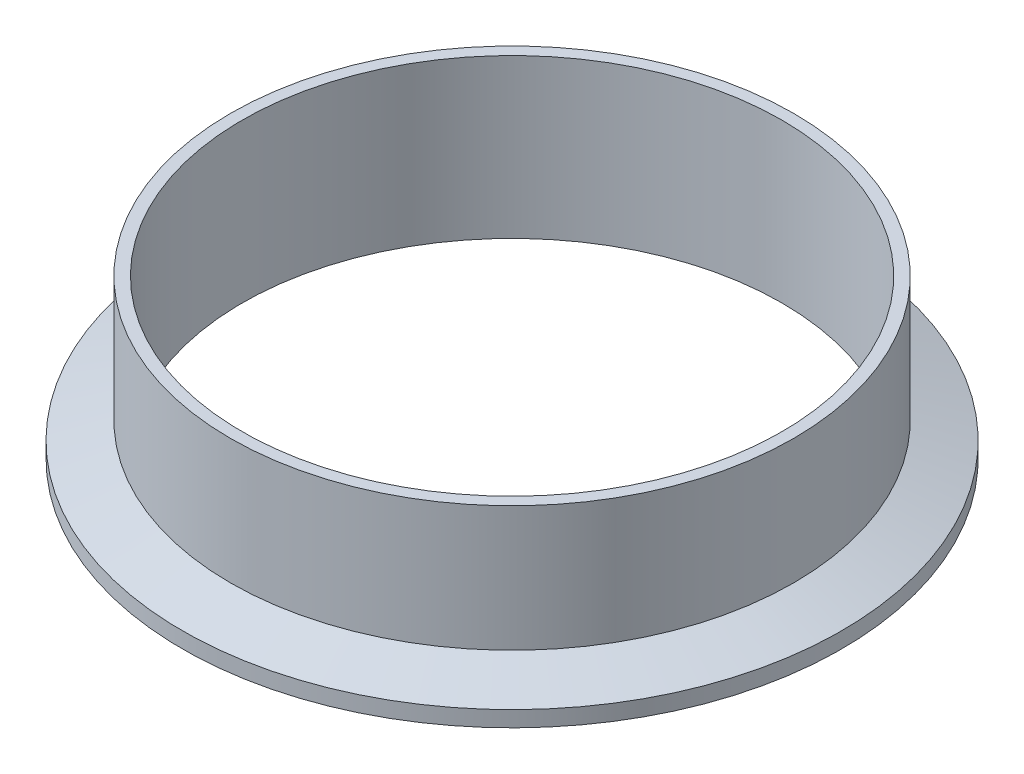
ISO-10303-21;
HEADER;
FILE_DESCRIPTION(('STEP AP214'),'2;1');
FILE_NAME('part.step','',(''),(''),'','','');
FILE_SCHEMA(('AUTOMOTIVE_DESIGN { 1 0 10303 214 1 1 1 1 }'));
ENDSEC;
DATA;
#1=APPLICATION_CONTEXT('core data for automotive mechanical design processes');
#2=APPLICATION_PROTOCOL_DEFINITION('international standard','automotive_design',2000,#1);
#3=PRODUCT_CONTEXT('',#1,'mechanical');
#4=PRODUCT('Part','Part','',(#3));
#5=PRODUCT_RELATED_PRODUCT_CATEGORY('part','',(#4));
#6=PRODUCT_DEFINITION_FORMATION('','',#4);
#7=PRODUCT_DEFINITION_CONTEXT('part definition',#1,'design');
#8=PRODUCT_DEFINITION('design','',#6,#7);
#9=PRODUCT_DEFINITION_SHAPE('','',#8);
#10=(LENGTH_UNIT() NAMED_UNIT(*) SI_UNIT(.MILLI.,.METRE.));
#11=(NAMED_UNIT(*) PLANE_ANGLE_UNIT() SI_UNIT($,.RADIAN.));
#12=(NAMED_UNIT(*) SI_UNIT($,.STERADIAN.) SOLID_ANGLE_UNIT());
#13=UNCERTAINTY_MEASURE_WITH_UNIT(LENGTH_MEASURE(1.E-05),#10,'distance_accuracy_value','');
#14=(GEOMETRIC_REPRESENTATION_CONTEXT(3) GLOBAL_UNCERTAINTY_ASSIGNED_CONTEXT((#13)) GLOBAL_UNIT_ASSIGNED_CONTEXT((#10,
#11,#12)) REPRESENTATION_CONTEXT('',''));
#15=CARTESIAN_POINT('',(0.,0.,0.));
#16=DIRECTION('',(0.,0.,1.));
#17=DIRECTION('',(1.,0.,0.));
#18=AXIS2_PLACEMENT_3D('',#15,#16,#17);
#19=CARTESIAN_POINT('',(0.,0.787399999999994,0.));
#20=DIRECTION('',(0.,-1.,0.));
#21=DIRECTION('',(0.,0.,-1.));
#22=AXIS2_PLACEMENT_3D('',#19,#20,#21);
#23=TOROIDAL_SURFACE('',#22,56.6185084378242,0.787400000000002);
#24=CARTESIAN_POINT('',(0.,0.,0.));
#25=DIRECTION('',(0.,-1.,0.));
#26=DIRECTION('',(0.,0.,-1.));
#27=AXIS2_PLACEMENT_3D('',#24,#25,#26);
#28=CIRCLE('',#27,56.6185084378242);
#29=CARTESIAN_POINT('',(0.,0.,-56.6185084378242));
#30=VERTEX_POINT('',#29);
#31=EDGE_CURVE('E74',#30,#30,#28,.T.);
#32=ORIENTED_EDGE('',*,*,#31,.T.);
#33=EDGE_LOOP('',(#32));
#34=FACE_BOUND('',#33,.T.);
#35=CARTESIAN_POINT('',(0.,0.474458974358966,0.));
#36=DIRECTION('',(0.,-1.,0.));
#37=DIRECTION('',(0.,0.,-1.));
#38=AXIS2_PLACEMENT_3D('',#35,#36,#37);
#39=CIRCLE('',#38,55.8959666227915);
#40=CARTESIAN_POINT('',(0.,0.474458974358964,-55.8959666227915));
#41=VERTEX_POINT('',#40);
#42=EDGE_CURVE('E12',#41,#41,#39,.T.);
#43=ORIENTED_EDGE('',*,*,#42,.F.);
#44=EDGE_LOOP('',(#43));
#45=FACE_BOUND('',#44,.T.);
#46=ADVANCED_FACE('F40',(#34,#45),#23,.T.);
#47=CARTESIAN_POINT('',(0.,0.,0.));
#48=DIRECTION('',(0.,-1.,0.));
#49=DIRECTION('',(0.,0.,-1.));
#50=AXIS2_PLACEMENT_3D('',#47,#48,#49);
#51=TOROIDAL_SURFACE('',#50,54.8005,1.1938);
#52=CARTESIAN_POINT('',(0.,0.474458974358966,0.));
#53=DIRECTION('',(0.,-1.,0.));
#54=DIRECTION('',(0.,0.,-1.));
#55=AXIS2_PLACEMENT_3D('',#52,#53,#54);
#56=CIRCLE('',#55,53.7050333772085);
#57=CARTESIAN_POINT('',(0.,0.474458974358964,-53.7050333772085));
#58=VERTEX_POINT('',#57);
#59=EDGE_CURVE('E46',#58,#58,#56,.T.);
#60=ORIENTED_EDGE('',*,*,#59,.F.);
#61=EDGE_LOOP('',(#60));
#62=FACE_BOUND('',#61,.T.);
#63=ORIENTED_EDGE('',*,*,#42,.T.);
#64=EDGE_LOOP('',(#63));
#65=FACE_BOUND('',#64,.T.);
#66=ADVANCED_FACE('F122',(#62,#65),#51,.F.);
#67=CARTESIAN_POINT('',(0.,0.787399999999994,0.));
#68=DIRECTION('',(0.,-1.,0.));
#69=DIRECTION('',(0.,0.,-1.));
#70=AXIS2_PLACEMENT_3D('',#67,#68,#69);
#71=TOROIDAL_SURFACE('',#70,52.9824915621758,0.787399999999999);
#72=ORIENTED_EDGE('',*,*,#59,.T.);
#73=EDGE_LOOP('',(#72));
#74=FACE_BOUND('',#73,.T.);
#75=CARTESIAN_POINT('',(0.,0.,0.));
#76=DIRECTION('',(0.,-1.,0.));
#77=DIRECTION('',(0.,0.,-1.));
#78=AXIS2_PLACEMENT_3D('',#75,#76,#77);
#79=CIRCLE('',#78,52.9824915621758);
#80=CARTESIAN_POINT('',(0.,0.,-52.9824915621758));
#81=VERTEX_POINT('',#80);
#82=EDGE_CURVE('E50',#81,#81,#79,.T.);
#83=ORIENTED_EDGE('',*,*,#82,.F.);
#84=EDGE_LOOP('',(#83));
#85=FACE_BOUND('',#84,.T.);
#86=ADVANCED_FACE('F118',(#74,#85),#71,.T.);
#87=CARTESIAN_POINT('',(0.,0.,0.));
#88=DIRECTION('',(0.,1.,0.));
#89=DIRECTION('',(0.,0.,1.));
#90=AXIS2_PLACEMENT_3D('',#87,#88,#89);
#91=PLANE('',#90);
#92=CARTESIAN_POINT('',(0.,0.,0.));
#93=DIRECTION('',(0.,-1.,0.));
#94=DIRECTION('',(0.,0.,-1.));
#95=AXIS2_PLACEMENT_3D('',#92,#93,#94);
#96=CIRCLE('',#95,48.6918);
#97=CARTESIAN_POINT('',(0.,0.,-48.6918));
#98=VERTEX_POINT('',#97);
#99=EDGE_CURVE('E54',#98,#98,#96,.T.);
#100=ORIENTED_EDGE('',*,*,#99,.F.);
#101=EDGE_LOOP('',(#100));
#102=FACE_BOUND('',#101,.T.);
#103=ORIENTED_EDGE('',*,*,#82,.T.);
#104=EDGE_LOOP('',(#103));
#105=FACE_BOUND('',#104,.T.);
#106=ADVANCED_FACE('F112',(#102,#105),#91,.F.);
#107=CARTESIAN_POINT('',(0.,0.,0.));
#108=DIRECTION('',(0.,-1.,0.));
#109=DIRECTION('',(0.,0.,-1.));
#110=AXIS2_PLACEMENT_3D('',#107,#108,#109);
#111=CYLINDRICAL_SURFACE('',#110,48.6918);
#112=ORIENTED_EDGE('',*,*,#99,.T.);
#113=EDGE_LOOP('',(#112));
#114=FACE_BOUND('',#113,.T.);
#115=CARTESIAN_POINT('',(0.,28.575,0.));
#116=DIRECTION('',(0.,-1.,0.));
#117=DIRECTION('',(0.,0.,-1.));
#118=AXIS2_PLACEMENT_3D('',#115,#116,#117);
#119=CIRCLE('',#118,48.6918);
#120=CARTESIAN_POINT('',(0.,28.575,-48.6918));
#121=VERTEX_POINT('',#120);
#122=EDGE_CURVE('E59',#121,#121,#119,.T.);
#123=ORIENTED_EDGE('',*,*,#122,.F.);
#124=EDGE_LOOP('',(#123));
#125=FACE_BOUND('',#124,.T.);
#126=ADVANCED_FACE('F107',(#114,#125),#111,.F.);
#127=CARTESIAN_POINT('',(0.,28.575,0.));
#128=DIRECTION('',(0.,-1.,0.));
#129=DIRECTION('',(0.,0.,-1.));
#130=AXIS2_PLACEMENT_3D('',#127,#128,#129);
#131=PLANE('',#130);
#132=CARTESIAN_POINT('',(0.,28.575,0.));
#133=DIRECTION('',(0.,-1.,0.));
#134=DIRECTION('',(0.,0.,-1.));
#135=AXIS2_PLACEMENT_3D('',#132,#133,#134);
#136=CIRCLE('',#135,50.8);
#137=CARTESIAN_POINT('',(0.,28.575,-50.8));
#138=VERTEX_POINT('',#137);
#139=EDGE_CURVE('E62',#138,#138,#136,.T.);
#140=ORIENTED_EDGE('',*,*,#139,.F.);
#141=EDGE_LOOP('',(#140));
#142=FACE_BOUND('',#141,.T.);
#143=ORIENTED_EDGE('',*,*,#122,.T.);
#144=EDGE_LOOP('',(#143));
#145=FACE_BOUND('',#144,.T.);
#146=ADVANCED_FACE('F101',(#142,#145),#131,.F.);
#147=CARTESIAN_POINT('',(0.,0.,0.));
#148=DIRECTION('',(0.,-1.,0.));
#149=DIRECTION('',(0.,0.,-1.));
#150=AXIS2_PLACEMENT_3D('',#147,#148,#149);
#151=CYLINDRICAL_SURFACE('',#150,50.8);
#152=CARTESIAN_POINT('',(0.,5.99729178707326,0.));
#153=DIRECTION('',(0.,-1.,0.));
#154=DIRECTION('',(0.,0.,-1.));
#155=AXIS2_PLACEMENT_3D('',#152,#153,#154);
#156=CIRCLE('',#155,50.8);
#157=CARTESIAN_POINT('',(0.,5.99729178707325,-50.8));
#158=VERTEX_POINT('',#157);
#159=EDGE_CURVE('E65',#158,#158,#156,.T.);
#160=ORIENTED_EDGE('',*,*,#159,.F.);
#161=EDGE_LOOP('',(#160));
#162=FACE_BOUND('',#161,.T.);
#163=ORIENTED_EDGE('',*,*,#139,.T.);
#164=EDGE_LOOP('',(#163));
#165=FACE_BOUND('',#164,.T.);
#166=ADVANCED_FACE('F95',(#162,#165),#151,.T.);
#167=CARTESIAN_POINT('',(0.,5.99729178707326,0.));
#168=DIRECTION('',(0.,-1.,0.));
#169=DIRECTION('',(0.,0.,-1.));
#170=AXIS2_PLACEMENT_3D('',#167,#168,#169);
#171=CONICAL_SURFACE('',#170,50.8,1.22173047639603);
#172=CARTESIAN_POINT('',(0.,2.84480000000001,0.));
#173=DIRECTION('',(0.,-1.,0.));
#174=DIRECTION('',(0.,0.,-1.));
#175=AXIS2_PLACEMENT_3D('',#172,#173,#174);
#176=CIRCLE('',#175,59.4614);
#177=CARTESIAN_POINT('',(0.,2.84480000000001,-59.4614));
#178=VERTEX_POINT('',#177);
#179=EDGE_CURVE('E68',#178,#178,#176,.T.);
#180=ORIENTED_EDGE('',*,*,#179,.F.);
#181=EDGE_LOOP('',(#180));
#182=FACE_BOUND('',#181,.T.);
#183=ORIENTED_EDGE('',*,*,#159,.T.);
#184=EDGE_LOOP('',(#183));
#185=FACE_BOUND('',#184,.T.);
#186=ADVANCED_FACE('F89',(#182,#185),#171,.T.);
#187=CARTESIAN_POINT('',(0.,0.,0.));
#188=DIRECTION('',(0.,-1.,0.));
#189=DIRECTION('',(0.,0.,-1.));
#190=AXIS2_PLACEMENT_3D('',#187,#188,#189);
#191=CYLINDRICAL_SURFACE('',#190,59.4614);
#192=CARTESIAN_POINT('',(0.,0.,0.));
#193=DIRECTION('',(0.,-1.,0.));
#194=DIRECTION('',(0.,0.,-1.));
#195=AXIS2_PLACEMENT_3D('',#192,#193,#194);
#196=CIRCLE('',#195,59.4614);
#197=CARTESIAN_POINT('',(0.,0.,-59.4614));
#198=VERTEX_POINT('',#197);
#199=EDGE_CURVE('E71',#198,#198,#196,.T.);
#200=ORIENTED_EDGE('',*,*,#199,.F.);
#201=EDGE_LOOP('',(#200));
#202=FACE_BOUND('',#201,.T.);
#203=ORIENTED_EDGE('',*,*,#179,.T.);
#204=EDGE_LOOP('',(#203));
#205=FACE_BOUND('',#204,.T.);
#206=ADVANCED_FACE('F83',(#202,#205),#191,.T.);
#207=CARTESIAN_POINT('',(0.,0.,0.));
#208=DIRECTION('',(0.,1.,0.));
#209=DIRECTION('',(0.,0.,1.));
#210=AXIS2_PLACEMENT_3D('',#207,#208,#209);
#211=PLANE('',#210);
#212=ORIENTED_EDGE('',*,*,#31,.F.);
#213=EDGE_LOOP('',(#212));
#214=FACE_BOUND('',#213,.T.);
#215=ORIENTED_EDGE('',*,*,#199,.T.);
#216=EDGE_LOOP('',(#215));
#217=FACE_BOUND('',#216,.T.);
#218=ADVANCED_FACE('F80',(#214,#217),#211,.F.);
#219=CLOSED_SHELL('',(#46,#66,#86,#106,#126,#146,#166,#186,#206,#218));
#220=MANIFOLD_SOLID_BREP('B2',#219);
#221=ADVANCED_BREP_SHAPE_REPRESENTATION('',(#18,#220),#14);
#222=SHAPE_DEFINITION_REPRESENTATION(#9,#221);
ENDSEC;
END-ISO-10303-21;
